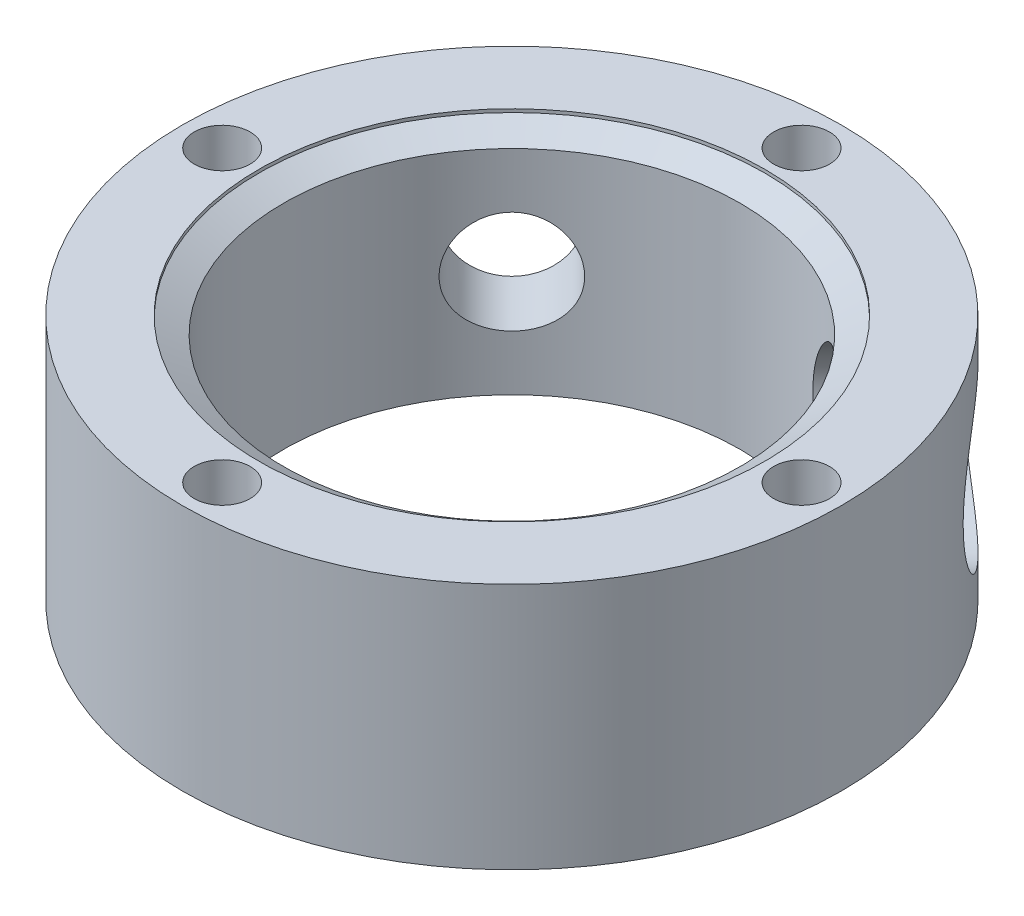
from build123d import *

# Parameters (mm, degrees)
SKETCH2_R          = 2.15265
CUT_EXTRUDE1_DEPTH = 41.659838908
SKETCH5_R          = 6.35
CUT_EXTRUDE4_DEPTH = 41.659838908
SKETCH6_R          = 3.96875
CUT_EXTRUDE5_DEPTH = 41.659839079
SKETCH7_R          = 8.89
CUT_EXTRUDE6_DEPTH = 0.762
CHAMFER1_SIZE      = 1.8796


with BuildPart() as part:
    # Sketch1 → Revolve2 (revolve)
    with BuildSketch(Plane.XY, mode=Mode.PRIVATE) as revolve2_sk:
        Polygon((19.4945, 0), (25.4, 0), (25.4, 19.05), (19.4945, 19.05), (19.4945, 18.796), (17.5895, 17.7419), (17.5895, 17.2339), (17.5895, 1.8161), (17.5895, 1.3081), (19.4945, 0.254), align=None)
    revolve(revolve2_sk.sketch.rotate(Axis((0, 0, 0), (0, 1, 0)), 90), axis=Axis((0, 0, 0), (0, 1, 0)))

    # Sketch2 → Cut-Extrude1 (cut, through all)
    with BuildSketch(Plane.XZ):
        with Locations(Location((0, -22.32406, 0), (0, 0, 270))):
            Circle(SKETCH2_R)
        with Locations(Location((22.32406, 0, 0), (0, 0, 270))):
            Circle(SKETCH2_R)
        with Locations(Location((-22.32406, 0, 0), (0, 0, 270))):
            Circle(SKETCH2_R)
        with Locations(Location((0, 22.32406, 0), (0, 0, 270))):
            Circle(SKETCH2_R)
    extrude(amount=-CUT_EXTRUDE1_DEPTH, mode=Mode.SUBTRACT)

    # Sketch5 → Cut-Extrude4 (cut, through all)
    with BuildSketch(Plane(origin=(0, 0, 0), x_dir=(0.7071067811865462, 0, 0.7071067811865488), z_dir=(-0.7071067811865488, 0, 0.7071067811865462))):
        with Locations((0, 9.525)):
            Circle(SKETCH5_R)
    extrude(amount=-CUT_EXTRUDE4_DEPTH, mode=Mode.SUBTRACT)

    # Sketch6 → Cut-Extrude5 (cut, through all)
    with BuildSketch(Plane(origin=(0, 0, 0), x_dir=(0.7071067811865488, 0, -0.7071067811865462), z_dir=(0.7071067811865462, 0, 0.7071067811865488))):
        with Locations((0, 9.525)):
            Circle(SKETCH6_R)
    extrude(amount=-CUT_EXTRUDE5_DEPTH, mode=Mode.SUBTRACT)

    # Sketch7 → Cut-Extrude6 (cut)
    with BuildSketch(Plane(origin=(-17.960512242, 0, -17.960512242), x_dir=(0.7071067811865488, 0, -0.7071067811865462), z_dir=(0.7071067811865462, 0, 0.7071067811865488))):
        with Locations((0, 9.303865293)):
            Circle(SKETCH7_R)
    extrude(amount=CUT_EXTRUDE6_DEPTH, mode=Mode.SUBTRACT)

    # Chamfer1
    chamfer1_edges = [part.edges().sort_by_distance(p)[0] for p in [
        (-20.228026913, 9.525, -14.615366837),
    ]]
    chamfer(chamfer1_edges, length=CHAMFER1_SIZE)


solid = part.part
